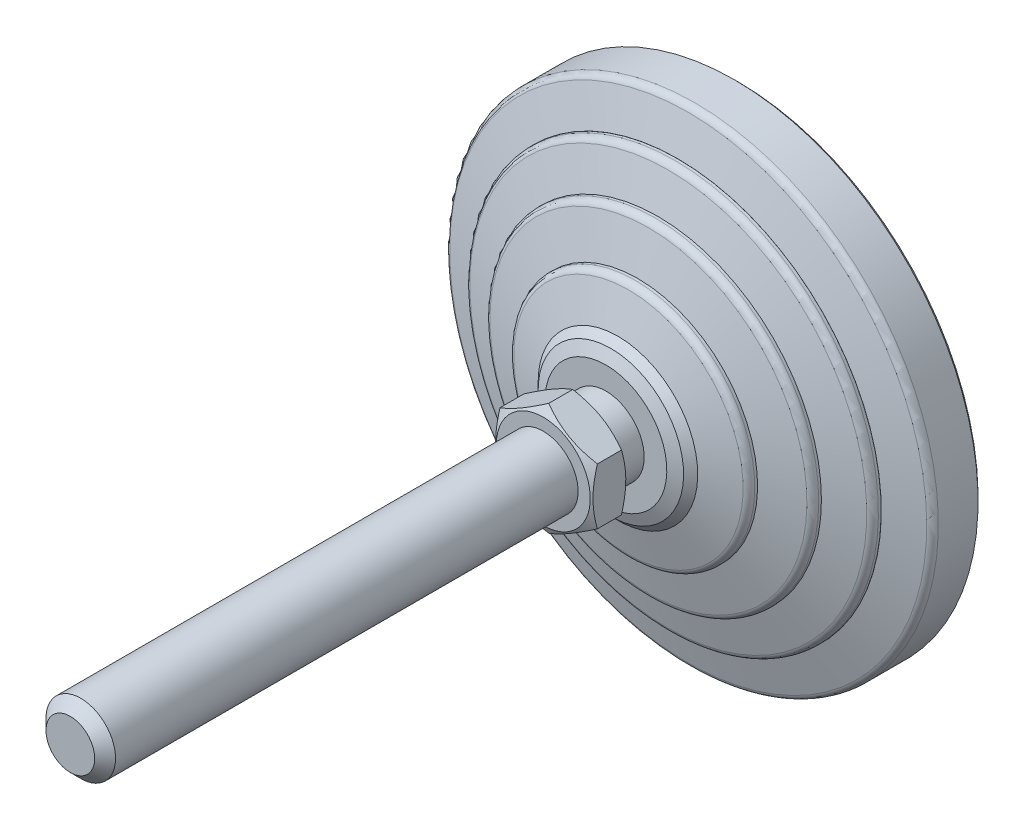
ISO-10303-21;
HEADER;
FILE_DESCRIPTION(('STEP AP214'),'2;1');
FILE_NAME('part.step','',(''),(''),'','','');
FILE_SCHEMA(('AUTOMOTIVE_DESIGN { 1 0 10303 214 1 1 1 1 }'));
ENDSEC;
DATA;
#1=APPLICATION_CONTEXT('core data for automotive mechanical design processes');
#2=APPLICATION_PROTOCOL_DEFINITION('international standard','automotive_design',2000,#1);
#3=PRODUCT_CONTEXT('',#1,'mechanical');
#4=PRODUCT('Part','Part','',(#3));
#5=PRODUCT_RELATED_PRODUCT_CATEGORY('part','',(#4));
#6=PRODUCT_DEFINITION_FORMATION('','',#4);
#7=PRODUCT_DEFINITION_CONTEXT('part definition',#1,'design');
#8=PRODUCT_DEFINITION('design','',#6,#7);
#9=PRODUCT_DEFINITION_SHAPE('','',#8);
#10=(LENGTH_UNIT() NAMED_UNIT(*) SI_UNIT(.MILLI.,.METRE.));
#11=(NAMED_UNIT(*) PLANE_ANGLE_UNIT() SI_UNIT($,.RADIAN.));
#12=(NAMED_UNIT(*) SI_UNIT($,.STERADIAN.) SOLID_ANGLE_UNIT());
#13=UNCERTAINTY_MEASURE_WITH_UNIT(LENGTH_MEASURE(1.E-05),#10,'distance_accuracy_value','');
#14=(GEOMETRIC_REPRESENTATION_CONTEXT(3) GLOBAL_UNCERTAINTY_ASSIGNED_CONTEXT((#13)) GLOBAL_UNIT_ASSIGNED_CONTEXT((#10,
#11,#12)) REPRESENTATION_CONTEXT('',''));
#15=CARTESIAN_POINT('',(0.,0.,0.));
#16=DIRECTION('',(0.,0.,1.));
#17=DIRECTION('',(1.,0.,0.));
#18=AXIS2_PLACEMENT_3D('',#15,#16,#17);
#19=CARTESIAN_POINT('',(-5.5,0.,23.));
#20=DIRECTION('',(0.,0.,1.));
#21=DIRECTION('',(0.,-1.,0.));
#22=AXIS2_PLACEMENT_3D('',#19,#20,#21);
#23=PLANE('',#22);
#24=CARTESIAN_POINT('',(0.,0.,23.));
#25=DIRECTION('',(0.,0.,-1.));
#26=DIRECTION('',(0.,1.,0.));
#27=AXIS2_PLACEMENT_3D('',#24,#25,#26);
#28=CIRCLE('',#27,5.5);
#29=CARTESIAN_POINT('',(0.,5.5,23.));
#30=VERTEX_POINT('',#29);
#31=EDGE_CURVE('E22',#30,#30,#28,.T.);
#32=ORIENTED_EDGE('',*,*,#31,.F.);
#33=EDGE_LOOP('',(#32));
#34=FACE_BOUND('',#33,.T.);
#35=CARTESIAN_POINT('',(0.,0.,22.9999999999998));
#36=DIRECTION('',(0.,0.,-1.));
#37=DIRECTION('',(-1.,0.,0.));
#38=AXIS2_PLACEMENT_3D('',#35,#36,#37);
#39=CIRCLE('',#38,6.75);
#40=CARTESIAN_POINT('',(-6.75,0.,22.9999999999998));
#41=VERTEX_POINT('',#40);
#42=EDGE_CURVE('E73',#41,#41,#39,.T.);
#43=ORIENTED_EDGE('',*,*,#42,.T.);
#44=EDGE_LOOP('',(#43));
#45=FACE_BOUND('',#44,.T.);
#46=ADVANCED_FACE('F14',(#34,#45),#23,.F.);
#47=CARTESIAN_POINT('',(0.,0.,0.));
#48=DIRECTION('',(0.,0.,-1.));
#49=DIRECTION('',(0.,1.,0.));
#50=AXIS2_PLACEMENT_3D('',#47,#48,#49);
#51=CYLINDRICAL_SURFACE('',#50,5.5);
#52=CARTESIAN_POINT('',(0.,0.,19.));
#53=DIRECTION('',(0.,0.,-1.));
#54=DIRECTION('',(0.,1.,0.));
#55=AXIS2_PLACEMENT_3D('',#52,#53,#54);
#56=CIRCLE('',#55,5.5);
#57=CARTESIAN_POINT('',(0.,5.5,19.));
#58=VERTEX_POINT('',#57);
#59=EDGE_CURVE('E151',#58,#58,#56,.T.);
#60=ORIENTED_EDGE('',*,*,#59,.F.);
#61=EDGE_LOOP('',(#60));
#62=FACE_BOUND('',#61,.T.);
#63=ORIENTED_EDGE('',*,*,#31,.T.);
#64=EDGE_LOOP('',(#63));
#65=FACE_BOUND('',#64,.T.);
#66=ADVANCED_FACE('F156',(#62,#65),#51,.T.);
#67=CARTESIAN_POINT('',(-8.75409836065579,0.,19.));
#68=DIRECTION('',(0.,0.,-1.));
#69=DIRECTION('',(0.,1.,0.));
#70=AXIS2_PLACEMENT_3D('',#67,#68,#69);
#71=PLANE('',#70);
#72=CARTESIAN_POINT('',(0.,0.,19.));
#73=DIRECTION('',(0.,0.,-1.));
#74=DIRECTION('',(0.,1.,0.));
#75=AXIS2_PLACEMENT_3D('',#72,#73,#74);
#76=CIRCLE('',#75,8.75409836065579);
#77=CARTESIAN_POINT('',(0.,8.75409836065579,19.));
#78=VERTEX_POINT('',#77);
#79=EDGE_CURVE('E148',#78,#78,#76,.T.);
#80=ORIENTED_EDGE('',*,*,#79,.F.);
#81=EDGE_LOOP('',(#80));
#82=FACE_BOUND('',#81,.T.);
#83=ORIENTED_EDGE('',*,*,#59,.T.);
#84=EDGE_LOOP('',(#83));
#85=FACE_BOUND('',#84,.T.);
#86=ADVANCED_FACE('F318',(#82,#85),#71,.F.);
#87=CARTESIAN_POINT('',(0.,0.,19.));
#88=DIRECTION('',(0.,0.,-1.));
#89=DIRECTION('',(0.,1.,0.));
#90=AXIS2_PLACEMENT_3D('',#87,#88,#89);
#91=CONICAL_SURFACE('',#90,8.75409836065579,1.17809724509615);
#92=CARTESIAN_POINT('',(0.,0.,18.2928932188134));
#93=DIRECTION('',(0.,0.,-1.));
#94=DIRECTION('',(0.,1.,0.));
#95=AXIS2_PLACEMENT_3D('',#92,#93,#94);
#96=CIRCLE('',#95,10.4612051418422);
#97=CARTESIAN_POINT('',(0.,10.4612051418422,18.2928932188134));
#98=VERTEX_POINT('',#97);
#99=EDGE_CURVE('E145',#98,#98,#96,.T.);
#100=ORIENTED_EDGE('',*,*,#99,.F.);
#101=EDGE_LOOP('',(#100));
#102=FACE_BOUND('',#101,.T.);
#103=ORIENTED_EDGE('',*,*,#79,.T.);
#104=EDGE_LOOP('',(#103));
#105=FACE_BOUND('',#104,.T.);
#106=ADVANCED_FACE('F314',(#102,#105),#91,.T.);
#107=CARTESIAN_POINT('',(0.,0.,18.2928932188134));
#108=DIRECTION('',(0.,0.,-1.));
#109=DIRECTION('',(0.,1.,0.));
#110=AXIS2_PLACEMENT_3D('',#107,#108,#109);
#111=CONICAL_SURFACE('',#110,10.4612051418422,0.785398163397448);
#112=CARTESIAN_POINT('',(0.,0.,17.2786885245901));
#113=DIRECTION('',(0.,0.,-1.));
#114=DIRECTION('',(0.,1.,0.));
#115=AXIS2_PLACEMENT_3D('',#112,#113,#114);
#116=CIRCLE('',#115,11.4754098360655);
#117=CARTESIAN_POINT('',(0.,11.4754098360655,17.2786885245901));
#118=VERTEX_POINT('',#117);
#119=EDGE_CURVE('E142',#118,#118,#116,.T.);
#120=ORIENTED_EDGE('',*,*,#119,.F.);
#121=EDGE_LOOP('',(#120));
#122=FACE_BOUND('',#121,.T.);
#123=ORIENTED_EDGE('',*,*,#99,.T.);
#124=EDGE_LOOP('',(#123));
#125=FACE_BOUND('',#124,.T.);
#126=ADVANCED_FACE('F310',(#122,#125),#111,.T.);
#127=CARTESIAN_POINT('',(0.,0.,17.2786885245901));
#128=DIRECTION('',(0.,0.,-1.));
#129=DIRECTION('',(0.,1.,0.));
#130=AXIS2_PLACEMENT_3D('',#127,#128,#129);
#131=CONICAL_SURFACE('',#130,11.4754098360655,1.27933953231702);
#132=CARTESIAN_POINT('',(0.,0.,15.7711726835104));
#133=DIRECTION('',(0.,0.,-1.));
#134=DIRECTION('',(0.,1.,0.));
#135=AXIS2_PLACEMENT_3D('',#132,#133,#134);
#136=CIRCLE('',#135,16.5004626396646);
#137=CARTESIAN_POINT('',(0.,16.5004626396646,15.7711726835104));
#138=VERTEX_POINT('',#137);
#139=EDGE_CURVE('E139',#138,#138,#136,.T.);
#140=ORIENTED_EDGE('',*,*,#139,.F.);
#141=EDGE_LOOP('',(#140));
#142=FACE_BOUND('',#141,.T.);
#143=ORIENTED_EDGE('',*,*,#119,.T.);
#144=EDGE_LOOP('',(#143));
#145=FACE_BOUND('',#144,.T.);
#146=ADVANCED_FACE('F306',(#142,#145),#131,.T.);
#147=CARTESIAN_POINT('',(0.,0.,14.8133463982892));
#148=DIRECTION('',(0.,0.,-1.));
#149=DIRECTION('',(0.,1.,0.));
#150=AXIS2_PLACEMENT_3D('',#147,#148,#149);
#151=TOROIDAL_SURFACE('',#150,16.2131147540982,1.);
#152=CARTESIAN_POINT('',(0.,0.,14.8133463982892));
#153=DIRECTION('',(0.,0.,-1.));
#154=DIRECTION('',(0.,1.,0.));
#155=AXIS2_PLACEMENT_3D('',#152,#153,#154);
#156=CIRCLE('',#155,17.2131147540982);
#157=CARTESIAN_POINT('',(0.,17.2131147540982,14.8133463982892));
#158=VERTEX_POINT('',#157);
#159=EDGE_CURVE('E136',#158,#158,#156,.T.);
#160=ORIENTED_EDGE('',*,*,#159,.F.);
#161=EDGE_LOOP('',(#160));
#162=FACE_BOUND('',#161,.T.);
#163=ORIENTED_EDGE('',*,*,#139,.T.);
#164=EDGE_LOOP('',(#163));
#165=FACE_BOUND('',#164,.T.);
#166=ADVANCED_FACE('F302',(#162,#165),#151,.T.);
#167=CARTESIAN_POINT('',(0.,0.,0.));
#168=DIRECTION('',(0.,0.,-1.));
#169=DIRECTION('',(0.,1.,0.));
#170=AXIS2_PLACEMENT_3D('',#167,#168,#169);
#171=CYLINDRICAL_SURFACE('',#170,17.2131147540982);
#172=CARTESIAN_POINT('',(0.,0.,14.4098360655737));
#173=DIRECTION('',(0.,0.,-1.));
#174=DIRECTION('',(0.,1.,0.));
#175=AXIS2_PLACEMENT_3D('',#172,#173,#174);
#176=CIRCLE('',#175,17.2131147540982);
#177=CARTESIAN_POINT('',(0.,17.2131147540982,14.4098360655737));
#178=VERTEX_POINT('',#177);
#179=EDGE_CURVE('E133',#178,#178,#176,.T.);
#180=ORIENTED_EDGE('',*,*,#179,.F.);
#181=EDGE_LOOP('',(#180));
#182=FACE_BOUND('',#181,.T.);
#183=ORIENTED_EDGE('',*,*,#159,.T.);
#184=EDGE_LOOP('',(#183));
#185=FACE_BOUND('',#184,.T.);
#186=ADVANCED_FACE('F298',(#182,#185),#171,.T.);
#187=CARTESIAN_POINT('',(0.,0.,14.4098360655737));
#188=DIRECTION('',(0.,0.,-1.));
#189=DIRECTION('',(0.,1.,0.));
#190=AXIS2_PLACEMENT_3D('',#187,#188,#189);
#191=CONICAL_SURFACE('',#190,17.2131147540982,1.30454427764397);
#192=CARTESIAN_POINT('',(0.,0.,12.8894925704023));
#193=DIRECTION('',(0.,0.,-1.));
#194=DIRECTION('',(0.,1.,0.));
#195=AXIS2_PLACEMENT_3D('',#192,#193,#194);
#196=CIRCLE('',#195,22.7877075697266);
#197=CARTESIAN_POINT('',(0.,22.7877075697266,12.8894925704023));
#198=VERTEX_POINT('',#197);
#199=EDGE_CURVE('E130',#198,#198,#196,.T.);
#200=ORIENTED_EDGE('',*,*,#199,.F.);
#201=EDGE_LOOP('',(#200));
#202=FACE_BOUND('',#201,.T.);
#203=ORIENTED_EDGE('',*,*,#179,.T.);
#204=EDGE_LOOP('',(#203));
#205=FACE_BOUND('',#204,.T.);
#206=ADVANCED_FACE('F294',(#202,#205),#191,.T.);
#207=CARTESIAN_POINT('',(0.,0.,11.9247287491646));
#208=DIRECTION('',(0.,0.,-1.));
#209=DIRECTION('',(0.,1.,0.));
#210=AXIS2_PLACEMENT_3D('',#207,#208,#209);
#211=TOROIDAL_SURFACE('',#210,22.5245901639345,1.);
#212=CARTESIAN_POINT('',(0.,0.,11.9247287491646));
#213=DIRECTION('',(0.,0.,-1.));
#214=DIRECTION('',(0.,1.,0.));
#215=AXIS2_PLACEMENT_3D('',#212,#213,#214);
#216=CIRCLE('',#215,23.5245901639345);
#217=CARTESIAN_POINT('',(0.,23.5245901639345,11.9247287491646));
#218=VERTEX_POINT('',#217);
#219=EDGE_CURVE('E127',#218,#218,#216,.T.);
#220=ORIENTED_EDGE('',*,*,#219,.F.);
#221=EDGE_LOOP('',(#220));
#222=FACE_BOUND('',#221,.T.);
#223=ORIENTED_EDGE('',*,*,#199,.T.);
#224=EDGE_LOOP('',(#223));
#225=FACE_BOUND('',#224,.T.);
#226=ADVANCED_FACE('F290',(#222,#225),#211,.T.);
#227=CARTESIAN_POINT('',(0.,0.,0.));
#228=DIRECTION('',(0.,0.,-1.));
#229=DIRECTION('',(0.,1.,0.));
#230=AXIS2_PLACEMENT_3D('',#227,#228,#229);
#231=CYLINDRICAL_SURFACE('',#230,23.5245901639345);
#232=CARTESIAN_POINT('',(0.,0.,11.5409836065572));
#233=DIRECTION('',(0.,0.,-1.));
#234=DIRECTION('',(0.,1.,0.));
#235=AXIS2_PLACEMENT_3D('',#232,#233,#234);
#236=CIRCLE('',#235,23.5245901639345);
#237=CARTESIAN_POINT('',(0.,23.5245901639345,11.5409836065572));
#238=VERTEX_POINT('',#237);
#239=EDGE_CURVE('E124',#238,#238,#236,.T.);
#240=ORIENTED_EDGE('',*,*,#239,.F.);
#241=EDGE_LOOP('',(#240));
#242=FACE_BOUND('',#241,.T.);
#243=ORIENTED_EDGE('',*,*,#219,.T.);
#244=EDGE_LOOP('',(#243));
#245=FACE_BOUND('',#244,.T.);
#246=ADVANCED_FACE('F286',(#242,#245),#231,.T.);
#247=CARTESIAN_POINT('',(0.,0.,11.5409836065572));
#248=DIRECTION('',(0.,0.,-1.));
#249=DIRECTION('',(0.,1.,0.));
#250=AXIS2_PLACEMENT_3D('',#247,#248,#249);
#251=CONICAL_SURFACE('',#250,23.5245901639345,1.2787125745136);
#252=CARTESIAN_POINT('',(0.,0.,10.0337743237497));
#253=DIRECTION('',(0.,0.,-1.));
#254=DIRECTION('',(0.,1.,0.));
#255=AXIS2_PLACEMENT_3D('',#252,#253,#254);
#256=CIRCLE('',#255,28.5372004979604);
#257=CARTESIAN_POINT('',(0.,28.5372004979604,10.0337743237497));
#258=VERTEX_POINT('',#257);
#259=EDGE_CURVE('E121',#258,#258,#256,.T.);
#260=ORIENTED_EDGE('',*,*,#259,.F.);
#261=EDGE_LOOP('',(#260));
#262=FACE_BOUND('',#261,.T.);
#263=ORIENTED_EDGE('',*,*,#239,.T.);
#264=EDGE_LOOP('',(#263));
#265=FACE_BOUND('',#264,.T.);
#266=ADVANCED_FACE('F282',(#262,#265),#251,.T.);
#267=CARTESIAN_POINT('',(0.,0.,9.07612838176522));
#268=DIRECTION('',(0.,0.,-1.));
#269=DIRECTION('',(0.,1.,0.));
#270=AXIS2_PLACEMENT_3D('',#267,#268,#269);
#271=TOROIDAL_SURFACE('',#270,28.2492521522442,1.);
#272=CARTESIAN_POINT('',(0.,0.,9.07612838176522));
#273=DIRECTION('',(0.,0.,-1.));
#274=DIRECTION('',(0.,1.,0.));
#275=AXIS2_PLACEMENT_3D('',#272,#273,#274);
#276=CIRCLE('',#275,29.2492521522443);
#277=CARTESIAN_POINT('',(0.,29.2492521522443,9.07612838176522));
#278=VERTEX_POINT('',#277);
#279=EDGE_CURVE('E118',#278,#278,#276,.T.);
#280=ORIENTED_EDGE('',*,*,#279,.F.);
#281=EDGE_LOOP('',(#280));
#282=FACE_BOUND('',#281,.T.);
#283=ORIENTED_EDGE('',*,*,#259,.T.);
#284=EDGE_LOOP('',(#283));
#285=FACE_BOUND('',#284,.T.);
#286=ADVANCED_FACE('F278',(#282,#285),#271,.T.);
#287=CARTESIAN_POINT('',(0.,0.,0.));
#288=DIRECTION('',(0.,0.,-1.));
#289=DIRECTION('',(0.,1.,0.));
#290=AXIS2_PLACEMENT_3D('',#287,#288,#289);
#291=CYLINDRICAL_SURFACE('',#290,29.2492521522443);
#292=CARTESIAN_POINT('',(0.,0.,8.67213114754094));
#293=DIRECTION('',(0.,0.,-1.));
#294=DIRECTION('',(0.,1.,0.));
#295=AXIS2_PLACEMENT_3D('',#292,#293,#294);
#296=CIRCLE('',#295,29.2492521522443);
#297=CARTESIAN_POINT('',(0.,29.2492521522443,8.67213114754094));
#298=VERTEX_POINT('',#297);
#299=EDGE_CURVE('E115',#298,#298,#296,.T.);
#300=ORIENTED_EDGE('',*,*,#299,.F.);
#301=EDGE_LOOP('',(#300));
#302=FACE_BOUND('',#301,.T.);
#303=ORIENTED_EDGE('',*,*,#279,.T.);
#304=EDGE_LOOP('',(#303));
#305=FACE_BOUND('',#304,.T.);
#306=ADVANCED_FACE('F274',(#302,#305),#291,.T.);
#307=CARTESIAN_POINT('',(-29.2622950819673,0.,8.67213114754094));
#308=DIRECTION('',(0.,0.,-1.));
#309=DIRECTION('',(0.,1.,0.));
#310=AXIS2_PLACEMENT_3D('',#307,#308,#309);
#311=PLANE('',#310);
#312=CARTESIAN_POINT('',(0.,0.,8.67213114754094));
#313=DIRECTION('',(0.,0.,-1.));
#314=DIRECTION('',(0.,1.,0.));
#315=AXIS2_PLACEMENT_3D('',#312,#313,#314);
#316=CIRCLE('',#315,29.2622950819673);
#317=CARTESIAN_POINT('',(0.,29.2622950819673,8.67213114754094));
#318=VERTEX_POINT('',#317);
#319=EDGE_CURVE('E112',#318,#318,#316,.T.);
#320=ORIENTED_EDGE('',*,*,#319,.F.);
#321=EDGE_LOOP('',(#320));
#322=FACE_BOUND('',#321,.T.);
#323=ORIENTED_EDGE('',*,*,#299,.T.);
#324=EDGE_LOOP('',(#323));
#325=FACE_BOUND('',#324,.T.);
#326=ADVANCED_FACE('F270',(#322,#325),#311,.F.);
#327=CARTESIAN_POINT('',(0.,0.,8.67213114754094));
#328=DIRECTION('',(0.,0.,-1.));
#329=DIRECTION('',(0.,1.,0.));
#330=AXIS2_PLACEMENT_3D('',#327,#328,#329);
#331=CONICAL_SURFACE('',#330,29.2622950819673,1.27933953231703);
#332=CARTESIAN_POINT('',(0.,0.,7.16461530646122));
#333=DIRECTION('',(0.,0.,-1.));
#334=DIRECTION('',(0.,1.,0.));
#335=AXIS2_PLACEMENT_3D('',#332,#333,#334);
#336=CIRCLE('',#335,34.2873478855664);
#337=CARTESIAN_POINT('',(0.,34.2873478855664,7.16461530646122));
#338=VERTEX_POINT('',#337);
#339=EDGE_CURVE('E109',#338,#338,#336,.T.);
#340=ORIENTED_EDGE('',*,*,#339,.F.);
#341=EDGE_LOOP('',(#340));
#342=FACE_BOUND('',#341,.T.);
#343=ORIENTED_EDGE('',*,*,#319,.T.);
#344=EDGE_LOOP('',(#343));
#345=FACE_BOUND('',#344,.T.);
#346=ADVANCED_FACE('F266',(#342,#345),#331,.T.);
#347=CARTESIAN_POINT('',(0.,0.,6.20678902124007));
#348=DIRECTION('',(0.,0.,-1.));
#349=DIRECTION('',(0.,1.,0.));
#350=AXIS2_PLACEMENT_3D('',#347,#348,#349);
#351=TOROIDAL_SURFACE('',#350,34.,1.);
#352=CARTESIAN_POINT('',(0.,0.,6.20678902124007));
#353=DIRECTION('',(0.,0.,-1.));
#354=DIRECTION('',(0.,1.,0.));
#355=AXIS2_PLACEMENT_3D('',#352,#353,#354);
#356=CIRCLE('',#355,35.);
#357=CARTESIAN_POINT('',(0.,35.,6.20678902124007));
#358=VERTEX_POINT('',#357);
#359=EDGE_CURVE('E106',#358,#358,#356,.T.);
#360=ORIENTED_EDGE('',*,*,#359,.F.);
#361=EDGE_LOOP('',(#360));
#362=FACE_BOUND('',#361,.T.);
#363=ORIENTED_EDGE('',*,*,#339,.T.);
#364=EDGE_LOOP('',(#363));
#365=FACE_BOUND('',#364,.T.);
#366=ADVANCED_FACE('F262',(#362,#365),#351,.T.);
#367=CARTESIAN_POINT('',(0.,0.,0.));
#368=DIRECTION('',(0.,0.,-1.));
#369=DIRECTION('',(0.,1.,0.));
#370=AXIS2_PLACEMENT_3D('',#367,#368,#369);
#371=CYLINDRICAL_SURFACE('',#370,35.);
#372=CARTESIAN_POINT('',(0.,0.,0.5));
#373=DIRECTION('',(0.,0.,-1.));
#374=DIRECTION('',(0.,1.,0.));
#375=AXIS2_PLACEMENT_3D('',#372,#373,#374);
#376=CIRCLE('',#375,35.);
#377=CARTESIAN_POINT('',(0.,35.,0.5));
#378=VERTEX_POINT('',#377);
#379=EDGE_CURVE('E103',#378,#378,#376,.T.);
#380=ORIENTED_EDGE('',*,*,#379,.F.);
#381=EDGE_LOOP('',(#380));
#382=FACE_BOUND('',#381,.T.);
#383=ORIENTED_EDGE('',*,*,#359,.T.);
#384=EDGE_LOOP('',(#383));
#385=FACE_BOUND('',#384,.T.);
#386=ADVANCED_FACE('F258',(#382,#385),#371,.T.);
#387=CARTESIAN_POINT('',(0.,0.,0.5));
#388=DIRECTION('',(0.,0.,1.));
#389=DIRECTION('',(0.,-1.,0.));
#390=AXIS2_PLACEMENT_3D('',#387,#388,#389);
#391=CONICAL_SURFACE('',#390,35.,0.785398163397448);
#392=CARTESIAN_POINT('',(0.,0.,0.));
#393=DIRECTION('',(0.,0.,-1.));
#394=DIRECTION('',(0.,1.,0.));
#395=AXIS2_PLACEMENT_3D('',#392,#393,#394);
#396=CIRCLE('',#395,34.5);
#397=CARTESIAN_POINT('',(0.,34.5,0.));
#398=VERTEX_POINT('',#397);
#399=EDGE_CURVE('E100',#398,#398,#396,.T.);
#400=ORIENTED_EDGE('',*,*,#399,.F.);
#401=EDGE_LOOP('',(#400));
#402=FACE_BOUND('',#401,.T.);
#403=ORIENTED_EDGE('',*,*,#379,.T.);
#404=EDGE_LOOP('',(#403));
#405=FACE_BOUND('',#404,.T.);
#406=ADVANCED_FACE('F254',(#402,#405),#391,.T.);
#407=CARTESIAN_POINT('',(-34.5,0.,0.));
#408=DIRECTION('',(0.,0.,1.));
#409=DIRECTION('',(0.,-1.,0.));
#410=AXIS2_PLACEMENT_3D('',#407,#408,#409);
#411=PLANE('',#410);
#412=ORIENTED_EDGE('',*,*,#399,.T.);
#413=EDGE_LOOP('',(#412));
#414=FACE_BOUND('',#413,.T.);
#415=ADVANCED_FACE('F183',(#414),#411,.F.);
#416=CARTESIAN_POINT('',(0.,0.,22.9999999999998));
#417=DIRECTION('',(0.,0.,1.));
#418=DIRECTION('',(1.,0.,0.));
#419=AXIS2_PLACEMENT_3D('',#416,#417,#418);
#420=CONICAL_SURFACE('',#419,6.75,1.0471975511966);
#421=CARTESIAN_POINT('',(-7.,-10.8415671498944,26.5536032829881));
#422=CARTESIAN_POINT('',(-7.,-10.535949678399,26.4054088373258));
#423=CARTESIAN_POINT('',(-7.,-10.229629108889,26.2586394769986));
#424=CARTESIAN_POINT('',(-7.,-9.61520779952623,25.9687527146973));
#425=CARTESIAN_POINT('',(-7.,-9.30710678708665,25.825635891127));
#426=CARTESIAN_POINT('',(-7.,-8.68715635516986,25.5431329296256));
#427=CARTESIAN_POINT('',(-7.,-8.37529565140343,25.4037714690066));
#428=CARTESIAN_POINT('',(-7.,-7.74908885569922,25.1307707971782));
#429=CARTESIAN_POINT('',(-7.,-7.43474288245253,24.9971313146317));
#430=CARTESIAN_POINT('',(-7.,-6.79297556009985,24.7329320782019));
#431=CARTESIAN_POINT('',(-7.,-6.46545713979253,24.6026068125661));
#432=CARTESIAN_POINT('',(-7.,-5.80658408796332,24.3518543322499));
#433=CARTESIAN_POINT('',(-7.,-5.47522902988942,24.2314282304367));
#434=CARTESIAN_POINT('',(-7.,-4.80877633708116,24.0036463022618));
#435=CARTESIAN_POINT('',(-7.,-4.47368788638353,23.8962638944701));
#436=CARTESIAN_POINT('',(-7.,-3.79871646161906,23.6980230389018));
#437=CARTESIAN_POINT('',(-7.,-3.4588350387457,23.6071593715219));
#438=CARTESIAN_POINT('',(-7.,-2.77591109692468,23.4468143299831));
#439=CARTESIAN_POINT('',(-7.,-2.43289641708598,23.3772175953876));
#440=CARTESIAN_POINT('',(-7.,-1.9152622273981,23.2917930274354));
#441=CARTESIAN_POINT('',(-7.,-1.7421859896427,23.2664787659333));
#442=CARTESIAN_POINT('',(-7.,-1.39517809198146,23.2226706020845));
#443=CARTESIAN_POINT('',(-7.,-1.22124651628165,23.2041760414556));
#444=CARTESIAN_POINT('',(-7.,-0.875026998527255,23.1746069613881));
#445=CARTESIAN_POINT('',(-7.,-0.702747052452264,23.1634391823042));
#446=CARTESIAN_POINT('',(-7.,-0.3578693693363,23.1483979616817));
#447=CARTESIAN_POINT('',(-7.,-0.185271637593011,23.1445243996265));
#448=CARTESIAN_POINT('',(-7.,0.159933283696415,23.144163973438));
#449=CARTESIAN_POINT('',(-7.,0.332540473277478,23.1476771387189));
#450=CARTESIAN_POINT('',(-7.,0.677453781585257,23.1620045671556));
#451=CARTESIAN_POINT('',(-7.,0.849759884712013,23.172819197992));
#452=CARTESIAN_POINT('',(-7.,1.26429506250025,23.207391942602));
#453=CARTESIAN_POINT('',(-7.,1.50623930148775,23.2346382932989));
#454=CARTESIAN_POINT('',(-7.,1.98831132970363,23.3020370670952));
#455=CARTESIAN_POINT('',(-7.,2.22843886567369,23.3421912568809));
#456=CARTESIAN_POINT('',(-7.,2.94583342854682,23.4798846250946));
#457=CARTESIAN_POINT('',(-7.,3.41984070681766,23.5946289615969));
#458=CARTESIAN_POINT('',(-7.,4.12859171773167,23.7933483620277));
#459=CARTESIAN_POINT('',(-7.,4.36701814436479,23.8649419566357));
#460=CARTESIAN_POINT('',(-7.,4.8415547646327,24.0155010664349));
#461=CARTESIAN_POINT('',(-7.,5.07766494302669,24.0944666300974));
#462=CARTESIAN_POINT('',(-7.,5.54764459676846,24.2585080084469));
#463=CARTESIAN_POINT('',(-7.,5.78151479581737,24.3435817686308));
#464=CARTESIAN_POINT('',(-7.,6.24732178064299,24.5188449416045));
#465=CARTESIAN_POINT('',(-7.,6.47925858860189,24.6090342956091));
#466=CARTESIAN_POINT('',(-7.,7.02476724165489,24.8269797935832));
#467=CARTESIAN_POINT('',(-7.,7.33761169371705,24.9565531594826));
#468=CARTESIAN_POINT('',(-7.,7.96065752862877,25.221923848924));
#469=CARTESIAN_POINT('',(-7.,8.27085875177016,25.3577215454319));
#470=CARTESIAN_POINT('',(-7.,8.88910202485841,25.6342957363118));
#471=CARTESIAN_POINT('',(-7.,9.19714363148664,25.7750732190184));
#472=CARTESIAN_POINT('',(-7.,9.81137704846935,26.0606144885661));
#473=CARTESIAN_POINT('',(-7.,10.1175688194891,26.2053783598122));
#474=CARTESIAN_POINT('',(-7.,10.7287213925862,26.4982987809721));
#475=CARTESIAN_POINT('',(-7.,11.0336805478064,26.6464587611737));
#476=CARTESIAN_POINT('',(-7.,11.6422883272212,26.9454488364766));
#477=CARTESIAN_POINT('',(-7.,11.9459369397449,27.0962789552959));
#478=CARTESIAN_POINT('',(-7.,12.8551492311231,27.5520269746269));
#479=CARTESIAN_POINT('',(-7.,13.4590602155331,27.8602416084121));
#480=CARTESIAN_POINT('',(-7.,14.6134261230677,28.4568882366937));
#481=CARTESIAN_POINT('',(-7.,15.1641378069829,28.7448256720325));
#482=CARTESIAN_POINT('',(-7.,16.2635142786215,29.3246254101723));
#483=CARTESIAN_POINT('',(-7.,16.8121789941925,29.6164878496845));
#484=CARTESIAN_POINT('',(-7.,17.9065570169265,30.2024787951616));
#485=CARTESIAN_POINT('',(-7.,18.4522742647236,30.4965999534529));
#486=CARTESIAN_POINT('',(-7.,19.5423990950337,31.0871896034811));
#487=CARTESIAN_POINT('',(-7.,20.0868067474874,31.3836579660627));
#488=CARTESIAN_POINT('',(-7.,20.6307319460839,31.6810029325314));
#489=B_SPLINE_CURVE_WITH_KNOTS('',3,(#421,#422,#423,#424,#425,#426,#427,#428,#429,#430,#431,
#432,#433,#434,#435,#436,#437,#438,#439,#440,#441,#442,#443,#444,#445,#446,#447,#448,#449,#450,
#451,#452,#453,#454,#455,#456,#457,#458,#459,#460,#461,#462,#463,#464,#465,#466,#467,#468,#469,
#470,#471,#472,#473,#474,#475,#476,#477,#478,#479,#480,#481,#482,#483,#484,#485,#486,#487,#488),
.UNSPECIFIED.,.F.,.F.,(4,2,2,2,2,2,2,2,2,2,2,2,2,2,2,2,2,2,2,2,2,2,2,2,2,2,2,2,2,2,2,2,2,4),(0.,
1.01896917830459,2.03809872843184,3.06280066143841,4.08745394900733,5.14481592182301,
6.20229660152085,7.25758476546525,8.31253889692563,9.36166456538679,9.88630439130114,
10.4108935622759,10.9286687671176,11.4464354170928,11.9642041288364,12.4819989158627,
13.2120068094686,13.9421146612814,15.4031454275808,16.1499140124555,16.8966875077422,
17.6432109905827,18.3897258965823,19.4054837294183,20.4213025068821,21.4373240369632,
22.4533670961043,23.4704860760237,24.4876140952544,26.5216007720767,28.3859127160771,
30.250289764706,32.1100769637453,33.9697625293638),.UNSPECIFIED.);
#490=CARTESIAN_POINT('',(-7.,4.04145188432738,23.7695523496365));
#491=VERTEX_POINT('',#490);
#492=CARTESIAN_POINT('',(-7.,-4.04145188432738,23.7695523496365));
#493=VERTEX_POINT('',#492);
#494=EDGE_CURVE('E79',#491,#493,#489,.F.);
#495=ORIENTED_EDGE('',*,*,#494,.F.);
#496=CARTESIAN_POINT('',(0.000199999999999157,8.0830192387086,23.7696190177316));
#497=CARTESIAN_POINT('',(-0.153667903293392,7.99418356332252,23.7183374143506));
#498=CARTESIAN_POINT('',(-0.308109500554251,7.90501666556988,23.6693831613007));
#499=CARTESIAN_POINT('',(-0.618246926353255,7.72595873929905,23.5767703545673));
#500=CARTESIAN_POINT('',(-0.773943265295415,7.63606741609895,23.5331140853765));
#501=CARTESIAN_POINT('',(-1.24352516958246,7.36495417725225,23.4109491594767));
#502=CARTESIAN_POINT('',(-1.5592643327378,7.18266208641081,23.3414631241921));
#503=CARTESIAN_POINT('',(-2.03176224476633,6.9098652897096,23.2599825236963));
#504=CARTESIAN_POINT('',(-2.18710922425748,6.82017566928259,23.2367710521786));
#505=CARTESIAN_POINT('',(-2.49850511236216,6.64039116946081,23.1978487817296));
#506=CARTESIAN_POINT('',(-2.65455395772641,6.55029632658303,23.1821373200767));
#507=CARTESIAN_POINT('',(-2.96692267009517,6.36995016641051,23.1586154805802));
#508=CARTESIAN_POINT('',(-3.12324202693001,6.27969914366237,23.15079613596));
#509=CARTESIAN_POINT('',(-3.43601650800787,6.09911871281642,23.1432178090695));
#510=CARTESIAN_POINT('',(-3.59247162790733,6.00878930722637,23.1434585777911));
#511=CARTESIAN_POINT('',(-4.02110687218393,5.76131663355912,23.1551972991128));
#512=CARTESIAN_POINT('',(-4.2931466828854,5.60425437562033,23.1749033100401));
#513=CARTESIAN_POINT('',(-4.83541944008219,5.29117305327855,23.2373910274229));
#514=CARTESIAN_POINT('',(-5.10565047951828,5.13515508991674,23.2801940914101));
#515=CARTESIAN_POINT('',(-5.64901454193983,4.82144370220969,23.3871892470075));
#516=CARTESIAN_POINT('',(-5.92207900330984,4.66378986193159,23.4518346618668));
#517=CARTESIAN_POINT('',(-6.46413578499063,4.35083323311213,23.5985536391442));
#518=CARTESIAN_POINT('',(-6.73313504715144,4.19552643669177,23.6805927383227));
#519=CARTESIAN_POINT('',(-7.0002,4.04133641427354,23.7696190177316));
#520=B_SPLINE_CURVE_WITH_KNOTS('',3,(#496,#497,#498,#499,#500,#501,#502,#503,#504,#505,#506,
#507,#508,#509,#510,#511,#512,#513,#514,#515,#516,#517,#518,#519),.UNSPECIFIED.,.F.,.F.,(4,2,2,
2,2,2,2,2,2,2,2,4),(0.,0.554727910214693,1.10969417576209,2.2219327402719,2.76443041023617,
3.30688013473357,3.84871284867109,4.39052882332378,5.33376515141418,6.27787517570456,
7.2429241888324,8.20607866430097),.UNSPECIFIED.);
#521=CARTESIAN_POINT('',(0.,8.08290376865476,23.7695523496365));
#522=VERTEX_POINT('',#521);
#523=EDGE_CURVE('E199',#522,#491,#520,.T.);
#524=ORIENTED_EDGE('',*,*,#523,.F.);
#525=CARTESIAN_POINT('',(7.0002,4.04133641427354,23.7696190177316));
#526=CARTESIAN_POINT('',(6.84633209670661,4.13017208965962,23.7183374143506));
#527=CARTESIAN_POINT('',(6.69189049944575,4.21933898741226,23.6693831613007));
#528=CARTESIAN_POINT('',(6.38175307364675,4.39839691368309,23.5767703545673));
#529=CARTESIAN_POINT('',(6.22605673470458,4.48828823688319,23.5331140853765));
#530=CARTESIAN_POINT('',(5.75647483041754,4.75940147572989,23.4109491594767));
#531=CARTESIAN_POINT('',(5.4407356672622,4.94169356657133,23.3414631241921));
#532=CARTESIAN_POINT('',(4.96823775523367,5.21449036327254,23.2599825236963));
#533=CARTESIAN_POINT('',(4.81289077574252,5.30417998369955,23.2367710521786));
#534=CARTESIAN_POINT('',(4.50149488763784,5.48396448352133,23.1978487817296));
#535=CARTESIAN_POINT('',(4.34544604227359,5.57405932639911,23.1821373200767));
#536=CARTESIAN_POINT('',(4.03307732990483,5.75440548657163,23.1586154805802));
#537=CARTESIAN_POINT('',(3.87675797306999,5.84465650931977,23.15079613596));
#538=CARTESIAN_POINT('',(3.56398349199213,6.02523694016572,23.1432178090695));
#539=CARTESIAN_POINT('',(3.40752837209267,6.11556634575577,23.1434585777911));
#540=CARTESIAN_POINT('',(2.97889312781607,6.36303901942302,23.1551972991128));
#541=CARTESIAN_POINT('',(2.7068533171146,6.52010127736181,23.1749033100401));
#542=CARTESIAN_POINT('',(2.16458055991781,6.83318259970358,23.2373910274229));
#543=CARTESIAN_POINT('',(1.89434952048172,6.9892005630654,23.2801940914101));
#544=CARTESIAN_POINT('',(1.35098545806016,7.30291195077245,23.3871892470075));
#545=CARTESIAN_POINT('',(1.07792099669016,7.46056579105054,23.4518346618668));
#546=CARTESIAN_POINT('',(0.535864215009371,7.77352241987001,23.5985536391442));
#547=CARTESIAN_POINT('',(0.266864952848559,7.92882921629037,23.6805927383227));
#548=CARTESIAN_POINT('',(-0.000200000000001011,8.0830192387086,23.7696190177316));
#549=B_SPLINE_CURVE_WITH_KNOTS('',3,(#525,#526,#527,#528,#529,#530,#531,#532,#533,#534,#535,
#536,#537,#538,#539,#540,#541,#542,#543,#544,#545,#546,#547,#548),.UNSPECIFIED.,.F.,.F.,(4,2,2,
2,2,2,2,2,2,2,2,4),(0.,0.554727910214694,1.10969417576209,2.2219327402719,2.76443041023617,
3.30688013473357,3.84871284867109,4.39052882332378,5.33376515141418,6.27787517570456,
7.2429241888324,8.20607866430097),.UNSPECIFIED.);
#550=CARTESIAN_POINT('',(7.,4.04145188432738,23.7695523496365));
#551=VERTEX_POINT('',#550);
#552=EDGE_CURVE('E192',#551,#522,#549,.T.);
#553=ORIENTED_EDGE('',*,*,#552,.F.);
#554=CARTESIAN_POINT('',(7.,-10.8415671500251,26.5536032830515));
#555=CARTESIAN_POINT('',(7.,-10.5359496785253,26.4054088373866));
#556=CARTESIAN_POINT('',(7.,-10.2296291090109,26.2586394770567));
#557=CARTESIAN_POINT('',(7.,-9.61520779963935,25.9687527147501));
#558=CARTESIAN_POINT('',(7.,-9.30710678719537,25.8256358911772));
#559=CARTESIAN_POINT('',(7.,-8.68715635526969,25.5431329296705));
#560=CARTESIAN_POINT('',(7.,-8.37529565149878,25.4037714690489));
#561=CARTESIAN_POINT('',(7.,-7.74908885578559,25.1307707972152));
#562=CARTESIAN_POINT('',(7.,-7.43474288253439,24.9971313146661));
#563=CARTESIAN_POINT('',(7.,-6.79297556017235,24.732932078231));
#564=CARTESIAN_POINT('',(7.,-6.46545713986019,24.6026068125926));
#565=CARTESIAN_POINT('',(7.,-5.80658408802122,24.3518543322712));
#566=CARTESIAN_POINT('',(7.,-5.4752290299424,24.2314282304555));
#567=CARTESIAN_POINT('',(7.,-4.80877633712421,24.0036463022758));
#568=CARTESIAN_POINT('',(7.,-4.47368788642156,23.8962638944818));
#569=CARTESIAN_POINT('',(7.,-3.79871646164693,23.6980230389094));
#570=CARTESIAN_POINT('',(7.,-3.45883503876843,23.6071593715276));
#571=CARTESIAN_POINT('',(7.,-2.7759110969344,23.446814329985));
#572=CARTESIAN_POINT('',(7.,-2.43289641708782,23.3772175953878));
#573=CARTESIAN_POINT('',(7.,-1.91526222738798,23.2917930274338));
#574=CARTESIAN_POINT('',(7.,-1.74218598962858,23.2664787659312));
#575=CARTESIAN_POINT('',(7.,-1.39517809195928,23.2226706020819));
#576=CARTESIAN_POINT('',(7.,-1.22124651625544,23.2041760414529));
#577=CARTESIAN_POINT('',(7.,-0.875026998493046,23.1746069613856));
#578=CARTESIAN_POINT('',(7.,-0.702747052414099,23.163439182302));
#579=CARTESIAN_POINT('',(7.,-0.357869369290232,23.1483979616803));
#580=CARTESIAN_POINT('',(7.,-0.185271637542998,23.1445243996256));
#581=CARTESIAN_POINT('',(7.,0.15993328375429,23.1441639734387));
#582=CARTESIAN_POINT('',(7.,0.332540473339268,23.1476771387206));
#583=CARTESIAN_POINT('',(7.,0.677453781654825,23.1620045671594));
#584=CARTESIAN_POINT('',(7.,0.849759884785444,23.1728191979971));
#585=CARTESIAN_POINT('',(7.,1.26429506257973,23.2073919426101));
#586=CARTESIAN_POINT('',(7.,1.50623930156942,23.2346382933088));
#587=CARTESIAN_POINT('',(7.,1.98831132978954,23.3020370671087));
#588=CARTESIAN_POINT('',(7.,2.22843886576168,23.3421912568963));
#589=CARTESIAN_POINT('',(7.,2.94583342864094,23.4798846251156));
#590=CARTESIAN_POINT('',(7.,3.41984070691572,23.5946289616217));
#591=CARTESIAN_POINT('',(7.,4.12859171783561,23.7933483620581));
#592=CARTESIAN_POINT('',(7.,4.36701814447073,23.8649419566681));
#593=CARTESIAN_POINT('',(7.,4.84155476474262,24.015501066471));
#594=CARTESIAN_POINT('',(7.,5.07766494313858,24.0944666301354));
#595=CARTESIAN_POINT('',(7.,5.54764459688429,24.2585080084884));
#596=CARTESIAN_POINT('',(7.,5.78151479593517,24.3435817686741));
#597=CARTESIAN_POINT('',(7.,6.24732178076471,24.5188449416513));
#598=CARTESIAN_POINT('',(7.,6.47925858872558,24.6090342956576));
#599=CARTESIAN_POINT('',(7.,7.02476724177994,24.8269797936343));
#600=CARTESIAN_POINT('',(7.,7.33761169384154,24.9565531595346));
#601=CARTESIAN_POINT('',(7.,7.9606575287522,25.2219238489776));
#602=CARTESIAN_POINT('',(7.,8.27085875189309,25.3577215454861));
#603=CARTESIAN_POINT('',(7.,8.88910202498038,25.6342957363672));
#604=CARTESIAN_POINT('',(7.,9.19714363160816,25.7750732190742));
#605=CARTESIAN_POINT('',(7.,9.81137704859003,26.0606144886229));
#606=CARTESIAN_POINT('',(7.,10.1175688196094,26.2053783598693));
#607=CARTESIAN_POINT('',(7.,10.7287213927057,26.4982987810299));
#608=CARTESIAN_POINT('',(7.,11.0336805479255,26.6464587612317));
#609=CARTESIAN_POINT('',(7.,11.6422883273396,26.9454488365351));
#610=CARTESIAN_POINT('',(7.,11.9459369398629,27.0962789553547));
#611=CARTESIAN_POINT('',(7.,12.8551492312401,27.5520269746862));
#612=CARTESIAN_POINT('',(7.,13.4590602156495,27.8602416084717));
#613=CARTESIAN_POINT('',(7.,14.6134261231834,28.4568882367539));
#614=CARTESIAN_POINT('',(7.,15.1641378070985,28.7448256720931));
#615=CARTESIAN_POINT('',(7.,16.2635142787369,29.3246254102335));
#616=CARTESIAN_POINT('',(7.,16.8121789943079,29.616487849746));
#617=CARTESIAN_POINT('',(7.,17.9065570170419,30.2024787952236));
#618=CARTESIAN_POINT('',(7.,18.4522742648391,30.4965999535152));
#619=CARTESIAN_POINT('',(7.,19.5423990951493,31.0871896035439));
#620=CARTESIAN_POINT('',(7.,20.0868067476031,31.3836579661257));
#621=CARTESIAN_POINT('',(7.,20.6307319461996,31.6810029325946));
#622=B_SPLINE_CURVE_WITH_KNOTS('',3,(#554,#555,#556,#557,#558,#559,#560,#561,#562,#563,#564,
#565,#566,#567,#568,#569,#570,#571,#572,#573,#574,#575,#576,#577,#578,#579,#580,#581,#582,#583,
#584,#585,#586,#587,#588,#589,#590,#591,#592,#593,#594,#595,#596,#597,#598,#599,#600,#601,#602,
#603,#604,#605,#606,#607,#608,#609,#610,#611,#612,#613,#614,#615,#616,#617,#618,#619,#620,#621),
.UNSPECIFIED.,.F.,.F.,(4,2,2,2,2,2,2,2,2,2,2,2,2,2,2,2,2,2,2,2,2,2,2,2,2,2,2,2,2,2,2,2,2,4),(0.,
1.01896917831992,2.0380987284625,3.06280066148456,4.08745394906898,5.1448159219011,
6.20229660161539,7.25758476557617,8.31253889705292,9.36166456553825,9.88630439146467,
10.4108935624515,10.928668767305,11.446435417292,11.9642041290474,12.4819989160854,
13.2120068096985,13.9421146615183,15.4031454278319,16.149914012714,16.896687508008,
17.6432109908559,18.3897258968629,19.4054837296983,20.4213025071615,21.437324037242,
22.4533670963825,23.4704860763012,24.4876140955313,26.5216007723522,28.3859127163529,
30.2502897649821,32.1100769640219,33.9697625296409),.UNSPECIFIED.);
#623=CARTESIAN_POINT('',(7.,-4.04145188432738,23.7695523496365));
#624=VERTEX_POINT('',#623);
#625=EDGE_CURVE('E29',#624,#551,#622,.T.);
#626=ORIENTED_EDGE('',*,*,#625,.F.);
#627=CARTESIAN_POINT('',(-0.000199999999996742,-8.08301923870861,23.7696190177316));
#628=CARTESIAN_POINT('',(0.153667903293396,-7.99418356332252,23.7183374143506));
#629=CARTESIAN_POINT('',(0.308109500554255,-7.90501666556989,23.6693831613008));
#630=CARTESIAN_POINT('',(0.618246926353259,-7.72595873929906,23.5767703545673));
#631=CARTESIAN_POINT('',(0.773943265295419,-7.63606741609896,23.5331140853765));
#632=CARTESIAN_POINT('',(1.24352516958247,-7.36495417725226,23.4109491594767));
#633=CARTESIAN_POINT('',(1.55926433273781,-7.18266208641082,23.3414631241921));
#634=CARTESIAN_POINT('',(2.03176224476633,-6.90986528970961,23.2599825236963));
#635=CARTESIAN_POINT('',(2.18710922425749,-6.82017566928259,23.2367710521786));
#636=CARTESIAN_POINT('',(2.49850511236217,-6.64039116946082,23.1978487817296));
#637=CARTESIAN_POINT('',(2.65455395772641,-6.55029632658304,23.1821373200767));
#638=CARTESIAN_POINT('',(2.96692267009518,-6.36995016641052,23.1586154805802));
#639=CARTESIAN_POINT('',(3.12324202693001,-6.27969914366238,23.15079613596));
#640=CARTESIAN_POINT('',(3.43601650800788,-6.09911871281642,23.1432178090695));
#641=CARTESIAN_POINT('',(3.59247162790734,-6.00878930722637,23.1434585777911));
#642=CARTESIAN_POINT('',(4.02110687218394,-5.76131663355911,23.1551972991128));
#643=CARTESIAN_POINT('',(4.2931466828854,-5.60425437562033,23.1749033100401));
#644=CARTESIAN_POINT('',(4.8354194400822,-5.29117305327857,23.2373910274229));
#645=CARTESIAN_POINT('',(5.10565047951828,-5.13515508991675,23.2801940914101));
#646=CARTESIAN_POINT('',(5.64901454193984,-4.8214437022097,23.3871892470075));
#647=CARTESIAN_POINT('',(5.92207900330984,-4.6637898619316,23.4518346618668));
#648=CARTESIAN_POINT('',(6.46413578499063,-4.35083323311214,23.5985536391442));
#649=CARTESIAN_POINT('',(6.73313504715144,-4.19552643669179,23.6805927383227));
#650=CARTESIAN_POINT('',(7.0002,-4.04133641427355,23.7696190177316));
#651=B_SPLINE_CURVE_WITH_KNOTS('',3,(#627,#628,#629,#630,#631,#632,#633,#634,#635,#636,#637,
#638,#639,#640,#641,#642,#643,#644,#645,#646,#647,#648,#649,#650),.UNSPECIFIED.,.F.,.F.,(4,2,2,
2,2,2,2,2,2,2,2,4),(0.,0.554727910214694,1.10969417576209,2.2219327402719,2.76443041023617,
3.30688013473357,3.8487128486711,4.39052882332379,5.33376515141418,6.27787517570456,
7.24292418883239,8.20607866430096),.UNSPECIFIED.);
#652=CARTESIAN_POINT('',(0.,-8.08290376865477,23.7695523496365));
#653=VERTEX_POINT('',#652);
#654=EDGE_CURVE('E66',#653,#624,#651,.T.);
#655=ORIENTED_EDGE('',*,*,#654,.F.);
#656=CARTESIAN_POINT('',(-7.0002,-4.04133641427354,23.7696190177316));
#657=CARTESIAN_POINT('',(-6.84633209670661,-4.13017208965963,23.7183374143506));
#658=CARTESIAN_POINT('',(-6.69189049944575,-4.21933898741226,23.6693831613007));
#659=CARTESIAN_POINT('',(-6.38175307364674,-4.3983969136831,23.5767703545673));
#660=CARTESIAN_POINT('',(-6.22605673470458,-4.48828823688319,23.5331140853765));
#661=CARTESIAN_POINT('',(-5.75647483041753,-4.7594014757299,23.4109491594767));
#662=CARTESIAN_POINT('',(-5.4407356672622,-4.94169356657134,23.3414631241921));
#663=CARTESIAN_POINT('',(-4.96823775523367,-5.21449036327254,23.2599825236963));
#664=CARTESIAN_POINT('',(-4.81289077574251,-5.30417998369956,23.2367710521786));
#665=CARTESIAN_POINT('',(-4.50149488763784,-5.48396448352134,23.1978487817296));
#666=CARTESIAN_POINT('',(-4.34544604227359,-5.57405932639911,23.1821373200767));
#667=CARTESIAN_POINT('',(-4.03307732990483,-5.75440548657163,23.1586154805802));
#668=CARTESIAN_POINT('',(-3.87675797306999,-5.84465650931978,23.15079613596));
#669=CARTESIAN_POINT('',(-3.56398349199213,-6.02523694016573,23.1432178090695));
#670=CARTESIAN_POINT('',(-3.40752837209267,-6.11556634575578,23.1434585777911));
#671=CARTESIAN_POINT('',(-2.97889312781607,-6.36303901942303,23.1551972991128));
#672=CARTESIAN_POINT('',(-2.7068533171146,-6.52010127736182,23.1749033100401));
#673=CARTESIAN_POINT('',(-2.1645805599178,-6.83318259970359,23.2373910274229));
#674=CARTESIAN_POINT('',(-1.89434952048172,-6.9892005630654,23.2801940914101));
#675=CARTESIAN_POINT('',(-1.35098545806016,-7.30291195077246,23.3871892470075));
#676=CARTESIAN_POINT('',(-1.07792099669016,-7.46056579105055,23.4518346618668));
#677=CARTESIAN_POINT('',(-0.53586421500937,-7.77352241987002,23.5985536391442));
#678=CARTESIAN_POINT('',(-0.266864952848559,-7.92882921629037,23.6805927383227));
#679=CARTESIAN_POINT('',(0.00020000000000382,-8.0830192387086,23.7696190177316));
#680=B_SPLINE_CURVE_WITH_KNOTS('',3,(#656,#657,#658,#659,#660,#661,#662,#663,#664,#665,#666,
#667,#668,#669,#670,#671,#672,#673,#674,#675,#676,#677,#678,#679),.UNSPECIFIED.,.F.,.F.,(4,2,2,
2,2,2,2,2,2,2,2,4),(0.,0.554727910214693,1.10969417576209,2.2219327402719,2.76443041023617,
3.30688013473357,3.8487128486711,4.39052882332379,5.33376515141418,6.27787517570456,
7.2429241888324,8.20607866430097),.UNSPECIFIED.);
#681=EDGE_CURVE('E69',#493,#653,#680,.T.);
#682=ORIENTED_EDGE('',*,*,#681,.F.);
#683=EDGE_LOOP('',(#495,#524,#553,#626,#655,#682));
#684=FACE_BOUND('',#683,.T.);
#685=ORIENTED_EDGE('',*,*,#42,.F.);
#686=EDGE_LOOP('',(#685));
#687=FACE_BOUND('',#686,.T.);
#688=ADVANCED_FACE('F67',(#684,#687),#420,.T.);
#689=CARTESIAN_POINT('',(-3.49999999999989,0.,96.));
#690=DIRECTION('',(0.,0.,-1.));
#691=DIRECTION('',(0.,1.,0.));
#692=AXIS2_PLACEMENT_3D('',#689,#690,#691);
#693=PLANE('',#692);
#694=CARTESIAN_POINT('',(0.,0.,96.));
#695=DIRECTION('',(0.,0.,-1.));
#696=DIRECTION('',(0.,1.,0.));
#697=AXIS2_PLACEMENT_3D('',#694,#695,#696);
#698=CIRCLE('',#697,3.49999999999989);
#699=CARTESIAN_POINT('',(0.,3.49999999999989,96.));
#700=VERTEX_POINT('',#699);
#701=EDGE_CURVE('E97',#700,#700,#698,.T.);
#702=ORIENTED_EDGE('',*,*,#701,.F.);
#703=EDGE_LOOP('',(#702));
#704=FACE_BOUND('',#703,.T.);
#705=ADVANCED_FACE('F182',(#704),#693,.F.);
#706=CARTESIAN_POINT('',(0.,0.,96.));
#707=DIRECTION('',(0.,0.,-1.));
#708=DIRECTION('',(0.,1.,0.));
#709=AXIS2_PLACEMENT_3D('',#706,#707,#708);
#710=CONICAL_SURFACE('',#709,3.49999999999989,0.785398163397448);
#711=CARTESIAN_POINT('',(0.,0.,94.5));
#712=DIRECTION('',(0.,0.,-1.));
#713=DIRECTION('',(0.,1.,0.));
#714=AXIS2_PLACEMENT_3D('',#711,#712,#713);
#715=CIRCLE('',#714,4.99999999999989);
#716=CARTESIAN_POINT('',(0.,4.99999999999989,94.5));
#717=VERTEX_POINT('',#716);
#718=EDGE_CURVE('E94',#717,#717,#715,.T.);
#719=ORIENTED_EDGE('',*,*,#718,.F.);
#720=EDGE_LOOP('',(#719));
#721=FACE_BOUND('',#720,.T.);
#722=ORIENTED_EDGE('',*,*,#701,.T.);
#723=EDGE_LOOP('',(#722));
#724=FACE_BOUND('',#723,.T.);
#725=ADVANCED_FACE('F244',(#721,#724),#710,.T.);
#726=CARTESIAN_POINT('',(0.,0.,0.));
#727=DIRECTION('',(0.,0.,-1.));
#728=DIRECTION('',(0.,1.,0.));
#729=AXIS2_PLACEMENT_3D('',#726,#727,#728);
#730=CYLINDRICAL_SURFACE('',#729,4.99999999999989);
#731=CARTESIAN_POINT('',(0.,0.,28.));
#732=DIRECTION('',(0.,0.,-1.));
#733=DIRECTION('',(0.,1.,0.));
#734=AXIS2_PLACEMENT_3D('',#731,#732,#733);
#735=CIRCLE('',#734,4.99999999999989);
#736=CARTESIAN_POINT('',(0.,4.99999999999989,28.));
#737=VERTEX_POINT('',#736);
#738=EDGE_CURVE('E9',#737,#737,#735,.T.);
#739=ORIENTED_EDGE('',*,*,#738,.F.);
#740=EDGE_LOOP('',(#739));
#741=FACE_BOUND('',#740,.T.);
#742=ORIENTED_EDGE('',*,*,#718,.T.);
#743=EDGE_LOOP('',(#742));
#744=FACE_BOUND('',#743,.T.);
#745=ADVANCED_FACE('F16',(#741,#744),#730,.T.);
#746=CARTESIAN_POINT('',(-4.99999999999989,0.,28.));
#747=DIRECTION('',(0.,0.,-1.));
#748=DIRECTION('',(0.,1.,0.));
#749=AXIS2_PLACEMENT_3D('',#746,#747,#748);
#750=PLANE('',#749);
#751=ORIENTED_EDGE('',*,*,#738,.T.);
#752=EDGE_LOOP('',(#751));
#753=FACE_BOUND('',#752,.T.);
#754=CARTESIAN_POINT('',(0.,0.,28.));
#755=DIRECTION('',(0.,0.,-1.));
#756=DIRECTION('',(-1.,0.,0.));
#757=AXIS2_PLACEMENT_3D('',#754,#755,#756);
#758=CIRCLE('',#757,6.75);
#759=CARTESIAN_POINT('',(-6.75,0.,28.));
#760=VERTEX_POINT('',#759);
#761=EDGE_CURVE('E78',#760,#760,#758,.T.);
#762=ORIENTED_EDGE('',*,*,#761,.F.);
#763=EDGE_LOOP('',(#762));
#764=FACE_BOUND('',#763,.T.);
#765=ADVANCED_FACE('F325',(#753,#764),#750,.F.);
#766=CARTESIAN_POINT('',(0.,0.,26.2025244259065));
#767=DIRECTION('',(0.,0.,-1.));
#768=DIRECTION('',(-1.,0.,0.));
#769=AXIS2_PLACEMENT_3D('',#766,#767,#768);
#770=CONICAL_SURFACE('',#769,9.86331901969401,1.0471975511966);
#771=CARTESIAN_POINT('',(7.0002,-4.04133641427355,27.2303809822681));
#772=CARTESIAN_POINT('',(6.84633209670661,-4.13017208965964,27.2816625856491));
#773=CARTESIAN_POINT('',(6.69189049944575,-4.21933898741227,27.330616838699));
#774=CARTESIAN_POINT('',(6.38175307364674,-4.3983969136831,27.4232296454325));
#775=CARTESIAN_POINT('',(6.22605673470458,-4.4882882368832,27.4668859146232));
#776=CARTESIAN_POINT('',(5.75647483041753,-4.7594014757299,27.5890508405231));
#777=CARTESIAN_POINT('',(5.4407356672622,-4.94169356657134,27.6585368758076));
#778=CARTESIAN_POINT('',(4.96823775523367,-5.21449036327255,27.7400174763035));
#779=CARTESIAN_POINT('',(4.81289077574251,-5.30417998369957,27.7632289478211));
#780=CARTESIAN_POINT('',(4.50149488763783,-5.48396448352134,27.8021512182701));
#781=CARTESIAN_POINT('',(4.34544604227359,-5.57405932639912,27.8178626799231));
#782=CARTESIAN_POINT('',(4.03307732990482,-5.75440548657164,27.8413845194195));
#783=CARTESIAN_POINT('',(3.87675797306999,-5.84465650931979,27.8492038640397));
#784=CARTESIAN_POINT('',(3.56398349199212,-6.02523694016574,27.8567821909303));
#785=CARTESIAN_POINT('',(3.40752837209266,-6.11556634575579,27.8565414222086));
#786=CARTESIAN_POINT('',(2.97889312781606,-6.36303901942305,27.844802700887));
#787=CARTESIAN_POINT('',(2.7068533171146,-6.52010127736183,27.8250966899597));
#788=CARTESIAN_POINT('',(2.1645805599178,-6.8331825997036,27.7626089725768));
#789=CARTESIAN_POINT('',(1.89434952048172,-6.98920056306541,27.7198059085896));
#790=CARTESIAN_POINT('',(1.35098545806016,-7.30291195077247,27.6128107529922));
#791=CARTESIAN_POINT('',(1.07792099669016,-7.46056579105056,27.5481653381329));
#792=CARTESIAN_POINT('',(0.535864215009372,-7.77352241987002,27.4014463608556));
#793=CARTESIAN_POINT('',(0.266864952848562,-7.92882921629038,27.319407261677));
#794=CARTESIAN_POINT('',(-0.00019999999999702,-8.08301923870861,27.2303809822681));
#795=B_SPLINE_CURVE_WITH_KNOTS('',3,(#771,#772,#773,#774,#775,#776,#777,#778,#779,#780,#781,
#782,#783,#784,#785,#786,#787,#788,#789,#790,#791,#792,#793,#794),.UNSPECIFIED.,.F.,.F.,(4,2,2,
2,2,2,2,2,2,2,2,4),(0.,0.554727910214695,1.10969417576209,2.2219327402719,2.76443041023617,
3.30688013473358,3.8487128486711,4.39052882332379,5.33376515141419,6.27787517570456,
7.2429241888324,8.20607866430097),.UNSPECIFIED.);
#796=CARTESIAN_POINT('',(7.,-4.04145188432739,27.2304476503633));
#797=VERTEX_POINT('',#796);
#798=CARTESIAN_POINT('',(0.,-8.08290376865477,27.2304476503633));
#799=VERTEX_POINT('',#798);
#800=EDGE_CURVE('E84',#797,#799,#795,.T.);
#801=ORIENTED_EDGE('',*,*,#800,.F.);
#802=CARTESIAN_POINT('',(7.,-10.8415671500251,24.4463967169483));
#803=CARTESIAN_POINT('',(7.,-10.5359496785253,24.5945911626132));
#804=CARTESIAN_POINT('',(7.,-10.2296291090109,24.7413605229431));
#805=CARTESIAN_POINT('',(7.,-9.61520779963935,25.0312472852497));
#806=CARTESIAN_POINT('',(7.,-9.30710678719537,25.1743641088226));
#807=CARTESIAN_POINT('',(7.,-8.68715635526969,25.4568670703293));
#808=CARTESIAN_POINT('',(7.,-8.37529565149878,25.5962285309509));
#809=CARTESIAN_POINT('',(7.,-7.74908885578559,25.8692292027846));
#810=CARTESIAN_POINT('',(7.,-7.43474288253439,26.0028686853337));
#811=CARTESIAN_POINT('',(7.,-6.79297556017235,26.2670679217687));
#812=CARTESIAN_POINT('',(7.,-6.46545713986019,26.3973931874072));
#813=CARTESIAN_POINT('',(7.,-5.80658408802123,26.6481456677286));
#814=CARTESIAN_POINT('',(7.,-5.47522902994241,26.7685717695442));
#815=CARTESIAN_POINT('',(7.,-4.80877633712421,26.996353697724));
#816=CARTESIAN_POINT('',(7.,-4.47368788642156,27.1037361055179));
#817=CARTESIAN_POINT('',(7.,-3.79871646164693,27.3019769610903));
#818=CARTESIAN_POINT('',(7.,-3.45883503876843,27.3928406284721));
#819=CARTESIAN_POINT('',(7.,-2.7759110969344,27.5531856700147));
#820=CARTESIAN_POINT('',(7.,-2.43289641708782,27.622782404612));
#821=CARTESIAN_POINT('',(7.,-1.91526222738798,27.708206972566));
#822=CARTESIAN_POINT('',(7.,-1.74218598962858,27.7335212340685));
#823=CARTESIAN_POINT('',(7.,-1.39517809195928,27.7773293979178));
#824=CARTESIAN_POINT('',(7.,-1.22124651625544,27.7958239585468));
#825=CARTESIAN_POINT('',(7.,-0.875026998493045,27.8253930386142));
#826=CARTESIAN_POINT('',(7.,-0.702747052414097,27.8365608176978));
#827=CARTESIAN_POINT('',(7.,-0.35786936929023,27.8516020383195));
#828=CARTESIAN_POINT('',(7.,-0.185271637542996,27.8554756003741));
#829=CARTESIAN_POINT('',(7.,0.159933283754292,27.8558360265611));
#830=CARTESIAN_POINT('',(7.,0.33254047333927,27.8523228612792));
#831=CARTESIAN_POINT('',(7.,0.677453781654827,27.8379954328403));
#832=CARTESIAN_POINT('',(7.,0.849759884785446,27.8271808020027));
#833=CARTESIAN_POINT('',(7.,1.26429506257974,27.7926080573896));
#834=CARTESIAN_POINT('',(7.,1.50623930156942,27.7653617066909));
#835=CARTESIAN_POINT('',(7.,1.98831132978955,27.697962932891));
#836=CARTESIAN_POINT('',(7.,2.22843886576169,27.6578087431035));
#837=CARTESIAN_POINT('',(7.,2.94583342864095,27.5201153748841));
#838=CARTESIAN_POINT('',(7.,3.41984070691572,27.405371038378));
#839=CARTESIAN_POINT('',(7.,4.12859171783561,27.2066516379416));
#840=CARTESIAN_POINT('',(7.,4.36701814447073,27.1350580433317));
#841=CARTESIAN_POINT('',(7.,4.84155476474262,26.9844989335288));
#842=CARTESIAN_POINT('',(7.,5.07766494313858,26.9055333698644));
#843=CARTESIAN_POINT('',(7.,5.54764459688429,26.7414919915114));
#844=CARTESIAN_POINT('',(7.,5.78151479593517,26.6564182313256));
#845=CARTESIAN_POINT('',(7.,6.24732178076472,26.4811550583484));
#846=CARTESIAN_POINT('',(7.,6.47925858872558,26.3909657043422));
#847=CARTESIAN_POINT('',(7.,7.02476724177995,26.1730202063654));
#848=CARTESIAN_POINT('',(7.,7.33761169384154,26.0434468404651));
#849=CARTESIAN_POINT('',(7.,7.96065752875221,25.7780761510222));
#850=CARTESIAN_POINT('',(7.,8.2708587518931,25.6422784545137));
#851=CARTESIAN_POINT('',(7.,8.88910202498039,25.3657042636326));
#852=CARTESIAN_POINT('',(7.,9.19714363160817,25.2249267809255));
#853=CARTESIAN_POINT('',(7.,9.81137704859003,24.9393855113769));
#854=CARTESIAN_POINT('',(7.,10.1175688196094,24.7946216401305));
#855=CARTESIAN_POINT('',(7.,10.7287213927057,24.5017012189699));
#856=CARTESIAN_POINT('',(7.,11.0336805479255,24.353541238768));
#857=CARTESIAN_POINT('',(7.,11.6422883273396,24.0545511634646));
#858=CARTESIAN_POINT('',(7.,11.9459369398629,23.9037210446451));
#859=CARTESIAN_POINT('',(7.,12.8551492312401,23.4479730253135));
#860=CARTESIAN_POINT('',(7.,13.4590602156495,23.139758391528));
#861=CARTESIAN_POINT('',(7.,14.6134261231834,22.5431117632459));
#862=CARTESIAN_POINT('',(7.,15.1641378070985,22.2551743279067));
#863=CARTESIAN_POINT('',(7.,16.2635142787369,21.6753745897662));
#864=CARTESIAN_POINT('',(7.,16.8121789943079,21.3835121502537));
#865=CARTESIAN_POINT('',(7.,17.9065570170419,20.7975212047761));
#866=CARTESIAN_POINT('',(7.,18.4522742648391,20.5034000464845));
#867=CARTESIAN_POINT('',(7.,19.5423990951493,19.9128103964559));
#868=CARTESIAN_POINT('',(7.,20.0868067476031,19.6163420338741));
#869=CARTESIAN_POINT('',(7.,20.6307319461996,19.3189970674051));
#870=B_SPLINE_CURVE_WITH_KNOTS('',3,(#802,#803,#804,#805,#806,#807,#808,#809,#810,#811,#812,
#813,#814,#815,#816,#817,#818,#819,#820,#821,#822,#823,#824,#825,#826,#827,#828,#829,#830,#831,
#832,#833,#834,#835,#836,#837,#838,#839,#840,#841,#842,#843,#844,#845,#846,#847,#848,#849,#850,
#851,#852,#853,#854,#855,#856,#857,#858,#859,#860,#861,#862,#863,#864,#865,#866,#867,#868,#869),
.UNSPECIFIED.,.F.,.F.,(4,2,2,2,2,2,2,2,2,2,2,2,2,2,2,2,2,2,2,2,2,2,2,2,2,2,2,2,2,2,2,2,2,4),(0.,
1.01896917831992,2.0380987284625,3.06280066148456,4.08745394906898,5.1448159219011,
6.20229660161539,7.25758476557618,8.31253889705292,9.36166456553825,9.88630439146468,
10.4108935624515,10.928668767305,11.446435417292,11.9642041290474,12.4819989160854,
13.2120068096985,13.9421146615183,15.4031454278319,16.149914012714,16.896687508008,
17.6432109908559,18.3897258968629,19.4054837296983,20.4213025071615,21.437324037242,
22.4533670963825,23.4704860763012,24.4876140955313,26.5216007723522,28.3859127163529,
30.2502897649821,32.1100769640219,33.9697625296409),.UNSPECIFIED.);
#871=CARTESIAN_POINT('',(7.,4.04145188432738,27.2304476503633));
#872=VERTEX_POINT('',#871);
#873=EDGE_CURVE('E341',#872,#797,#870,.F.);
#874=ORIENTED_EDGE('',*,*,#873,.F.);
#875=CARTESIAN_POINT('',(-0.000200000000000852,8.0830192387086,27.2303809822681));
#876=CARTESIAN_POINT('',(0.15366790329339,7.99418356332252,27.2816625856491));
#877=CARTESIAN_POINT('',(0.308109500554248,7.90501666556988,27.330616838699));
#878=CARTESIAN_POINT('',(0.618246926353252,7.72595873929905,27.4232296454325));
#879=CARTESIAN_POINT('',(0.773943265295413,7.63606741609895,27.4668859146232));
#880=CARTESIAN_POINT('',(1.24352516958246,7.36495417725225,27.5890508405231));
#881=CARTESIAN_POINT('',(1.5592643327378,7.18266208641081,27.6585368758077));
#882=CARTESIAN_POINT('',(2.03176224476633,6.9098652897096,27.7400174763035));
#883=CARTESIAN_POINT('',(2.18710922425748,6.82017566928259,27.7632289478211));
#884=CARTESIAN_POINT('',(2.49850511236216,6.64039116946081,27.8021512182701));
#885=CARTESIAN_POINT('',(2.6545539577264,6.55029632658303,27.8178626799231));
#886=CARTESIAN_POINT('',(2.96692267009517,6.36995016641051,27.8413845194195));
#887=CARTESIAN_POINT('',(3.12324202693,6.27969914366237,27.8492038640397));
#888=CARTESIAN_POINT('',(3.43601650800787,6.09911871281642,27.8567821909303));
#889=CARTESIAN_POINT('',(3.59247162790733,6.00878930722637,27.8565414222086));
#890=CARTESIAN_POINT('',(4.02110687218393,5.76131663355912,27.844802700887));
#891=CARTESIAN_POINT('',(4.2931466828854,5.60425437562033,27.8250966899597));
#892=CARTESIAN_POINT('',(4.8354194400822,5.29117305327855,27.7626089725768));
#893=CARTESIAN_POINT('',(5.10565047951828,5.13515508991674,27.7198059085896));
#894=CARTESIAN_POINT('',(5.64901454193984,4.82144370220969,27.6128107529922));
#895=CARTESIAN_POINT('',(5.92207900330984,4.66378986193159,27.5481653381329));
#896=CARTESIAN_POINT('',(6.46413578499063,4.35083323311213,27.4014463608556));
#897=CARTESIAN_POINT('',(6.73313504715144,4.19552643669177,27.319407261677));
#898=CARTESIAN_POINT('',(7.0002,4.04133641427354,27.2303809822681));
#899=B_SPLINE_CURVE_WITH_KNOTS('',3,(#875,#876,#877,#878,#879,#880,#881,#882,#883,#884,#885,
#886,#887,#888,#889,#890,#891,#892,#893,#894,#895,#896,#897,#898),.UNSPECIFIED.,.F.,.F.,(4,2,2,
2,2,2,2,2,2,2,2,4),(0.,0.554727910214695,1.10969417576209,2.2219327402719,2.76443041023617,
3.30688013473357,3.8487128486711,4.39052882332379,5.33376515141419,6.27787517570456,
7.2429241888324,8.20607866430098),.UNSPECIFIED.);
#900=CARTESIAN_POINT('',(0.,8.08290376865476,27.2304476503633));
#901=VERTEX_POINT('',#900);
#902=EDGE_CURVE('E353',#901,#872,#899,.T.);
#903=ORIENTED_EDGE('',*,*,#902,.F.);
#904=CARTESIAN_POINT('',(-7.0002,4.04133641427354,27.2303809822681));
#905=CARTESIAN_POINT('',(-6.84633209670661,4.13017208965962,27.2816625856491));
#906=CARTESIAN_POINT('',(-6.69189049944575,4.21933898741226,27.330616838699));
#907=CARTESIAN_POINT('',(-6.38175307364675,4.39839691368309,27.4232296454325));
#908=CARTESIAN_POINT('',(-6.22605673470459,4.48828823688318,27.4668859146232));
#909=CARTESIAN_POINT('',(-5.75647483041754,4.75940147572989,27.5890508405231));
#910=CARTESIAN_POINT('',(-5.4407356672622,4.94169356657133,27.6585368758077));
#911=CARTESIAN_POINT('',(-4.96823775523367,5.21449036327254,27.7400174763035));
#912=CARTESIAN_POINT('',(-4.81289077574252,5.30417998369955,27.7632289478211));
#913=CARTESIAN_POINT('',(-4.50149488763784,5.48396448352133,27.8021512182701));
#914=CARTESIAN_POINT('',(-4.34544604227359,5.57405932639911,27.8178626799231));
#915=CARTESIAN_POINT('',(-4.03307732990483,5.75440548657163,27.8413845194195));
#916=CARTESIAN_POINT('',(-3.87675797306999,5.84465650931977,27.8492038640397));
#917=CARTESIAN_POINT('',(-3.56398349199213,6.02523694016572,27.8567821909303));
#918=CARTESIAN_POINT('',(-3.40752837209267,6.11556634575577,27.8565414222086));
#919=CARTESIAN_POINT('',(-2.97889312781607,6.36303901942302,27.844802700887));
#920=CARTESIAN_POINT('',(-2.7068533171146,6.52010127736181,27.8250966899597));
#921=CARTESIAN_POINT('',(-2.1645805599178,6.83318259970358,27.7626089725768));
#922=CARTESIAN_POINT('',(-1.89434952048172,6.9892005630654,27.7198059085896));
#923=CARTESIAN_POINT('',(-1.35098545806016,7.30291195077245,27.6128107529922));
#924=CARTESIAN_POINT('',(-1.07792099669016,7.46056579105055,27.5481653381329));
#925=CARTESIAN_POINT('',(-0.53586421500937,7.77352241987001,27.4014463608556));
#926=CARTESIAN_POINT('',(-0.266864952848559,7.92882921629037,27.319407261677));
#927=CARTESIAN_POINT('',(0.000199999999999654,8.0830192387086,27.2303809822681));
#928=B_SPLINE_CURVE_WITH_KNOTS('',3,(#904,#905,#906,#907,#908,#909,#910,#911,#912,#913,#914,
#915,#916,#917,#918,#919,#920,#921,#922,#923,#924,#925,#926,#927),.UNSPECIFIED.,.F.,.F.,(4,2,2,
2,2,2,2,2,2,2,2,4),(0.,0.554727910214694,1.10969417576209,2.2219327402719,2.76443041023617,
3.30688013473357,3.8487128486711,4.39052882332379,5.33376515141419,6.27787517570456,
7.2429241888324,8.20607866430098),.UNSPECIFIED.);
#929=CARTESIAN_POINT('',(-7.,4.04145188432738,27.2304476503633));
#930=VERTEX_POINT('',#929);
#931=EDGE_CURVE('E229',#930,#901,#928,.T.);
#932=ORIENTED_EDGE('',*,*,#931,.F.);
#933=CARTESIAN_POINT('',(-7.,-10.8415671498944,24.4463967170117));
#934=CARTESIAN_POINT('',(-7.,-10.535949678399,24.5945911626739));
#935=CARTESIAN_POINT('',(-7.,-10.229629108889,24.7413605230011));
#936=CARTESIAN_POINT('',(-7.,-9.61520779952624,25.0312472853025));
#937=CARTESIAN_POINT('',(-7.,-9.30710678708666,25.1743641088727));
#938=CARTESIAN_POINT('',(-7.,-8.68715635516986,25.4568670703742));
#939=CARTESIAN_POINT('',(-7.,-8.37529565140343,25.5962285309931));
#940=CARTESIAN_POINT('',(-7.,-7.74908885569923,25.8692292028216));
#941=CARTESIAN_POINT('',(-7.,-7.43474288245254,26.0028686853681));
#942=CARTESIAN_POINT('',(-7.,-6.79297556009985,26.2670679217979));
#943=CARTESIAN_POINT('',(-7.,-6.46545713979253,26.3973931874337));
#944=CARTESIAN_POINT('',(-7.,-5.80658408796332,26.6481456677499));
#945=CARTESIAN_POINT('',(-7.,-5.47522902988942,26.768571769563));
#946=CARTESIAN_POINT('',(-7.,-4.80877633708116,26.996353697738));
#947=CARTESIAN_POINT('',(-7.,-4.47368788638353,27.1037361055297));
#948=CARTESIAN_POINT('',(-7.,-3.79871646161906,27.3019769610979));
#949=CARTESIAN_POINT('',(-7.,-3.4588350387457,27.3928406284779));
#950=CARTESIAN_POINT('',(-7.,-2.77591109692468,27.5531856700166));
#951=CARTESIAN_POINT('',(-7.,-2.43289641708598,27.6227824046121));
#952=CARTESIAN_POINT('',(-7.,-1.9152622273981,27.7082069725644));
#953=CARTESIAN_POINT('',(-7.,-1.7421859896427,27.7335212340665));
#954=CARTESIAN_POINT('',(-7.,-1.39517809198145,27.7773293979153));
#955=CARTESIAN_POINT('',(-7.,-1.22124651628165,27.7958239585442));
#956=CARTESIAN_POINT('',(-7.,-0.875026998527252,27.8253930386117));
#957=CARTESIAN_POINT('',(-7.,-0.702747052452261,27.8365608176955));
#958=CARTESIAN_POINT('',(-7.,-0.357869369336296,27.851602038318));
#959=CARTESIAN_POINT('',(-7.,-0.185271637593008,27.8554756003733));
#960=CARTESIAN_POINT('',(-7.,0.159933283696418,27.8558360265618));
#961=CARTESIAN_POINT('',(-7.,0.332540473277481,27.8523228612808));
#962=CARTESIAN_POINT('',(-7.,0.677453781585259,27.8379954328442));
#963=CARTESIAN_POINT('',(-7.,0.849759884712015,27.8271808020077));
#964=CARTESIAN_POINT('',(-7.,1.26429506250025,27.7926080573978));
#965=CARTESIAN_POINT('',(-7.,1.50623930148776,27.7653617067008));
#966=CARTESIAN_POINT('',(-7.,1.98831132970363,27.6979629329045));
#967=CARTESIAN_POINT('',(-7.,2.22843886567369,27.6578087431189));
#968=CARTESIAN_POINT('',(-7.,2.94583342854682,27.5201153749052));
#969=CARTESIAN_POINT('',(-7.,3.41984070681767,27.4053710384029));
#970=CARTESIAN_POINT('',(-7.,4.12859171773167,27.2066516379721));
#971=CARTESIAN_POINT('',(-7.,4.3670181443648,27.1350580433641));
#972=CARTESIAN_POINT('',(-7.,4.84155476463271,26.9844989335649));
#973=CARTESIAN_POINT('',(-7.,5.07766494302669,26.9055333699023));
#974=CARTESIAN_POINT('',(-7.,5.54764459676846,26.7414919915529));
#975=CARTESIAN_POINT('',(-7.,5.78151479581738,26.6564182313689));
#976=CARTESIAN_POINT('',(-7.,6.24732178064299,26.4811550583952));
#977=CARTESIAN_POINT('',(-7.,6.47925858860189,26.3909657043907));
#978=CARTESIAN_POINT('',(-7.,7.02476724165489,26.1730202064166));
#979=CARTESIAN_POINT('',(-7.,7.33761169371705,26.0434468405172));
#980=CARTESIAN_POINT('',(-7.,7.96065752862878,25.7780761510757));
#981=CARTESIAN_POINT('',(-7.,8.27085875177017,25.6422784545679));
#982=CARTESIAN_POINT('',(-7.,8.88910202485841,25.3657042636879));
#983=CARTESIAN_POINT('',(-7.,9.19714363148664,25.2249267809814));
#984=CARTESIAN_POINT('',(-7.,9.81137704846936,24.9393855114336));
#985=CARTESIAN_POINT('',(-7.,10.1175688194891,24.7946216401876));
#986=CARTESIAN_POINT('',(-7.,10.7287213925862,24.5017012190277));
#987=CARTESIAN_POINT('',(-7.,11.0336805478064,24.3535412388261));
#988=CARTESIAN_POINT('',(-7.,11.6422883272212,24.0545511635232));
#989=CARTESIAN_POINT('',(-7.,11.9459369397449,23.9037210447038));
#990=CARTESIAN_POINT('',(-7.,12.8551492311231,23.4479730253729));
#991=CARTESIAN_POINT('',(-7.,13.4590602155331,23.1397583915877));
#992=CARTESIAN_POINT('',(-7.,14.6134261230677,22.5431117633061));
#993=CARTESIAN_POINT('',(-7.,15.1641378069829,22.2551743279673));
#994=CARTESIAN_POINT('',(-7.,16.2635142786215,21.6753745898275));
#995=CARTESIAN_POINT('',(-7.,16.8121789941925,21.3835121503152));
#996=CARTESIAN_POINT('',(-7.,17.9065570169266,20.7975212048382));
#997=CARTESIAN_POINT('',(-7.,18.4522742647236,20.5034000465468));
#998=CARTESIAN_POINT('',(-7.,19.5423990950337,19.9128103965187));
#999=CARTESIAN_POINT('',(-7.,20.0868067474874,19.6163420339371));
#1000=CARTESIAN_POINT('',(-7.,20.6307319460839,19.3189970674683));
#1001=B_SPLINE_CURVE_WITH_KNOTS('',3,(#933,#934,#935,#936,#937,#938,#939,#940,#941,#942,#943,
#944,#945,#946,#947,#948,#949,#950,#951,#952,#953,#954,#955,#956,#957,#958,#959,#960,#961,#962,
#963,#964,#965,#966,#967,#968,#969,#970,#971,#972,#973,#974,#975,#976,#977,#978,#979,#980,#981,
#982,#983,#984,#985,#986,#987,#988,#989,#990,#991,#992,#993,#994,#995,#996,#997,#998,#999,
#1000),.UNSPECIFIED.,.F.,.F.,(4,2,2,2,2,2,2,2,2,2,2,2,2,2,2,2,2,2,2,2,2,2,2,2,2,2,2,2,2,2,2,2,2,
4),(0.,1.01896917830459,2.03809872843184,3.06280066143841,4.08745394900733,5.14481592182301,
6.20229660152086,7.25758476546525,8.31253889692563,9.36166456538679,9.88630439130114,
10.4108935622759,10.9286687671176,11.4464354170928,11.9642041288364,12.4819989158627,
13.2120068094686,13.9421146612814,15.4031454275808,16.1499140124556,16.8966875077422,
17.6432109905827,18.3897258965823,19.4054837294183,20.4213025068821,21.4373240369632,
22.4533670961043,23.4704860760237,24.4876140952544,26.5216007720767,28.3859127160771,
30.250289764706,32.1100769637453,33.9697625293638),.UNSPECIFIED.);
#1002=CARTESIAN_POINT('',(-7.,-4.04145188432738,27.2304476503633));
#1003=VERTEX_POINT('',#1002);
#1004=EDGE_CURVE('E90',#1003,#930,#1001,.T.);
#1005=ORIENTED_EDGE('',*,*,#1004,.F.);
#1006=CARTESIAN_POINT('',(0.000200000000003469,-8.0830192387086,27.2303809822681));
#1007=CARTESIAN_POINT('',(-0.153667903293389,-7.99418356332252,27.2816625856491));
#1008=CARTESIAN_POINT('',(-0.308109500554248,-7.90501666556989,27.330616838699));
#1009=CARTESIAN_POINT('',(-0.618246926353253,-7.72595873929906,27.4232296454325));
#1010=CARTESIAN_POINT('',(-0.773943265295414,-7.63606741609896,27.4668859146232));
#1011=CARTESIAN_POINT('',(-1.24352516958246,-7.36495417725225,27.5890508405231));
#1012=CARTESIAN_POINT('',(-1.5592643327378,-7.18266208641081,27.6585368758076));
#1013=CARTESIAN_POINT('',(-2.03176224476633,-6.90986528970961,27.7400174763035));
#1014=CARTESIAN_POINT('',(-2.18710922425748,-6.82017566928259,27.7632289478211));
#1015=CARTESIAN_POINT('',(-2.49850511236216,-6.64039116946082,27.8021512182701));
#1016=CARTESIAN_POINT('',(-2.6545539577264,-6.55029632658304,27.8178626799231));
#1017=CARTESIAN_POINT('',(-2.96692267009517,-6.36995016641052,27.8413845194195));
#1018=CARTESIAN_POINT('',(-3.12324202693,-6.27969914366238,27.8492038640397));
#1019=CARTESIAN_POINT('',(-3.43601650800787,-6.09911871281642,27.8567821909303));
#1020=CARTESIAN_POINT('',(-3.59247162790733,-6.00878930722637,27.8565414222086));
#1021=CARTESIAN_POINT('',(-4.02110687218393,-5.76131663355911,27.844802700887));
#1022=CARTESIAN_POINT('',(-4.29314668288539,-5.60425437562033,27.8250966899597));
#1023=CARTESIAN_POINT('',(-4.83541944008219,-5.29117305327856,27.7626089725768));
#1024=CARTESIAN_POINT('',(-5.10565047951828,-5.13515508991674,27.7198059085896));
#1025=CARTESIAN_POINT('',(-5.64901454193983,-4.82144370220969,27.6128107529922));
#1026=CARTESIAN_POINT('',(-5.92207900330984,-4.6637898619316,27.5481653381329));
#1027=CARTESIAN_POINT('',(-6.46413578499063,-4.35083323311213,27.4014463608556));
#1028=CARTESIAN_POINT('',(-6.73313504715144,-4.19552643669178,27.319407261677));
#1029=CARTESIAN_POINT('',(-7.0002,-4.04133641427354,27.2303809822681));
#1030=B_SPLINE_CURVE_WITH_KNOTS('',3,(#1006,#1007,#1008,#1009,#1010,#1011,#1012,#1013,#1014,
#1015,#1016,#1017,#1018,#1019,#1020,#1021,#1022,#1023,#1024,#1025,#1026,#1027,#1028,#1029),
.UNSPECIFIED.,.F.,.F.,(4,2,2,2,2,2,2,2,2,2,2,4),(0.,0.554727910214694,1.10969417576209,
2.2219327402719,2.76443041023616,3.30688013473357,3.84871284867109,4.39052882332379,
5.33376515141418,6.27787517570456,7.2429241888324,8.20607866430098),.UNSPECIFIED.);
#1031=EDGE_CURVE('E86',#799,#1003,#1030,.T.);
#1032=ORIENTED_EDGE('',*,*,#1031,.F.);
#1033=EDGE_LOOP('',(#801,#874,#903,#932,#1005,#1032));
#1034=FACE_BOUND('',#1033,.T.);
#1035=ORIENTED_EDGE('',*,*,#761,.T.);
#1036=EDGE_LOOP('',(#1035));
#1037=FACE_BOUND('',#1036,.T.);
#1038=ADVANCED_FACE('F184',(#1034,#1037),#770,.T.);
#1039=CARTESIAN_POINT('',(0.,-8.08290376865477,22.9999999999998));
#1040=DIRECTION('',(0.5,-0.866025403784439,0.));
#1041=DIRECTION('',(0.866025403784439,0.5,0.));
#1042=AXIS2_PLACEMENT_3D('',#1039,#1040,#1041);
#1043=PLANE('',#1042);
#1044=DIRECTION('',(0.,0.,1.));
#1045=VECTOR('',#1044,1.);
#1046=CARTESIAN_POINT('',(0.,-8.08290376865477,22.9999999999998));
#1047=LINE('',#1046,#1045);
#1048=EDGE_CURVE('E37',#653,#799,#1047,.T.);
#1049=ORIENTED_EDGE('',*,*,#1048,.F.);
#1050=ORIENTED_EDGE('',*,*,#654,.T.);
#1051=DIRECTION('',(0.,0.,1.));
#1052=VECTOR('',#1051,1.);
#1053=CARTESIAN_POINT('',(7.,-4.04145188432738,22.9999999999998));
#1054=LINE('',#1053,#1052);
#1055=EDGE_CURVE('E85',#624,#797,#1054,.T.);
#1056=ORIENTED_EDGE('',*,*,#1055,.T.);
#1057=ORIENTED_EDGE('',*,*,#800,.T.);
#1058=EDGE_LOOP('',(#1049,#1050,#1056,#1057));
#1059=FACE_BOUND('',#1058,.T.);
#1060=ADVANCED_FACE('F82',(#1059),#1043,.T.);
#1061=CARTESIAN_POINT('',(7.,-4.04145188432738,22.9999999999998));
#1062=DIRECTION('',(1.,0.,0.));
#1063=DIRECTION('',(0.,1.,0.));
#1064=AXIS2_PLACEMENT_3D('',#1061,#1062,#1063);
#1065=PLANE('',#1064);
#1066=ORIENTED_EDGE('',*,*,#1055,.F.);
#1067=ORIENTED_EDGE('',*,*,#625,.T.);
#1068=DIRECTION('',(0.,0.,1.));
#1069=VECTOR('',#1068,1.);
#1070=CARTESIAN_POINT('',(7.,4.04145188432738,22.9999999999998));
#1071=LINE('',#1070,#1069);
#1072=EDGE_CURVE('E88',#551,#872,#1071,.T.);
#1073=ORIENTED_EDGE('',*,*,#1072,.T.);
#1074=ORIENTED_EDGE('',*,*,#873,.T.);
#1075=EDGE_LOOP('',(#1066,#1067,#1073,#1074));
#1076=FACE_BOUND('',#1075,.T.);
#1077=ADVANCED_FACE('F358',(#1076),#1065,.T.);
#1078=CARTESIAN_POINT('',(7.,4.04145188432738,22.9999999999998));
#1079=DIRECTION('',(0.5,0.866025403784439,0.));
#1080=DIRECTION('',(-0.866025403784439,0.5,0.));
#1081=AXIS2_PLACEMENT_3D('',#1078,#1079,#1080);
#1082=PLANE('',#1081);
#1083=ORIENTED_EDGE('',*,*,#1072,.F.);
#1084=ORIENTED_EDGE('',*,*,#552,.T.);
#1085=DIRECTION('',(0.,0.,1.));
#1086=VECTOR('',#1085,1.);
#1087=CARTESIAN_POINT('',(0.,8.08290376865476,22.9999999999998));
#1088=LINE('',#1087,#1086);
#1089=EDGE_CURVE('E379',#522,#901,#1088,.T.);
#1090=ORIENTED_EDGE('',*,*,#1089,.T.);
#1091=ORIENTED_EDGE('',*,*,#902,.T.);
#1092=EDGE_LOOP('',(#1083,#1084,#1090,#1091));
#1093=FACE_BOUND('',#1092,.T.);
#1094=ADVANCED_FACE('F361',(#1093),#1082,.T.);
#1095=CARTESIAN_POINT('',(0.,8.08290376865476,22.9999999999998));
#1096=DIRECTION('',(-0.5,0.866025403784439,0.));
#1097=DIRECTION('',(-0.866025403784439,-0.5,0.));
#1098=AXIS2_PLACEMENT_3D('',#1095,#1096,#1097);
#1099=PLANE('',#1098);
#1100=ORIENTED_EDGE('',*,*,#1089,.F.);
#1101=ORIENTED_EDGE('',*,*,#523,.T.);
#1102=DIRECTION('',(0.,0.,1.));
#1103=VECTOR('',#1102,1.);
#1104=CARTESIAN_POINT('',(-7.,4.04145188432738,22.9999999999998));
#1105=LINE('',#1104,#1103);
#1106=EDGE_CURVE('E380',#491,#930,#1105,.T.);
#1107=ORIENTED_EDGE('',*,*,#1106,.T.);
#1108=ORIENTED_EDGE('',*,*,#931,.T.);
#1109=EDGE_LOOP('',(#1100,#1101,#1107,#1108));
#1110=FACE_BOUND('',#1109,.T.);
#1111=ADVANCED_FACE('F218',(#1110),#1099,.T.);
#1112=CARTESIAN_POINT('',(-7.,4.04145188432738,22.9999999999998));
#1113=DIRECTION('',(-1.,0.,0.));
#1114=DIRECTION('',(0.,-1.,0.));
#1115=AXIS2_PLACEMENT_3D('',#1112,#1113,#1114);
#1116=PLANE('',#1115);
#1117=ORIENTED_EDGE('',*,*,#1106,.F.);
#1118=ORIENTED_EDGE('',*,*,#494,.T.);
#1119=DIRECTION('',(0.,0.,1.));
#1120=VECTOR('',#1119,1.);
#1121=CARTESIAN_POINT('',(-7.,-4.04145188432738,22.9999999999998));
#1122=LINE('',#1121,#1120);
#1123=EDGE_CURVE('E77',#493,#1003,#1122,.T.);
#1124=ORIENTED_EDGE('',*,*,#1123,.T.);
#1125=ORIENTED_EDGE('',*,*,#1004,.T.);
#1126=EDGE_LOOP('',(#1117,#1118,#1124,#1125));
#1127=FACE_BOUND('',#1126,.T.);
#1128=ADVANCED_FACE('F215',(#1127),#1116,.T.);
#1129=CARTESIAN_POINT('',(-7.,-4.04145188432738,22.9999999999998));
#1130=DIRECTION('',(-0.5,-0.866025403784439,0.));
#1131=DIRECTION('',(0.866025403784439,-0.5,0.));
#1132=AXIS2_PLACEMENT_3D('',#1129,#1130,#1131);
#1133=PLANE('',#1132);
#1134=ORIENTED_EDGE('',*,*,#1123,.F.);
#1135=ORIENTED_EDGE('',*,*,#681,.T.);
#1136=ORIENTED_EDGE('',*,*,#1048,.T.);
#1137=ORIENTED_EDGE('',*,*,#1031,.T.);
#1138=EDGE_LOOP('',(#1134,#1135,#1136,#1137));
#1139=FACE_BOUND('',#1138,.T.);
#1140=ADVANCED_FACE('F76',(#1139),#1133,.T.);
#1141=CLOSED_SHELL('',(#46,#66,#86,#106,#126,#146,#166,#186,#206,#226,#246,#266,#286,#306,#326,
#346,#366,#386,#406,#415,#688,#705,#725,#745,#765,#1038,#1060,#1077,#1094,#1111,#1128,#1140));
#1142=MANIFOLD_SOLID_BREP('B1',#1141);
#1143=ADVANCED_BREP_SHAPE_REPRESENTATION('',(#18,#1142),#14);
#1144=SHAPE_DEFINITION_REPRESENTATION(#9,#1143);
ENDSEC;
END-ISO-10303-21;
